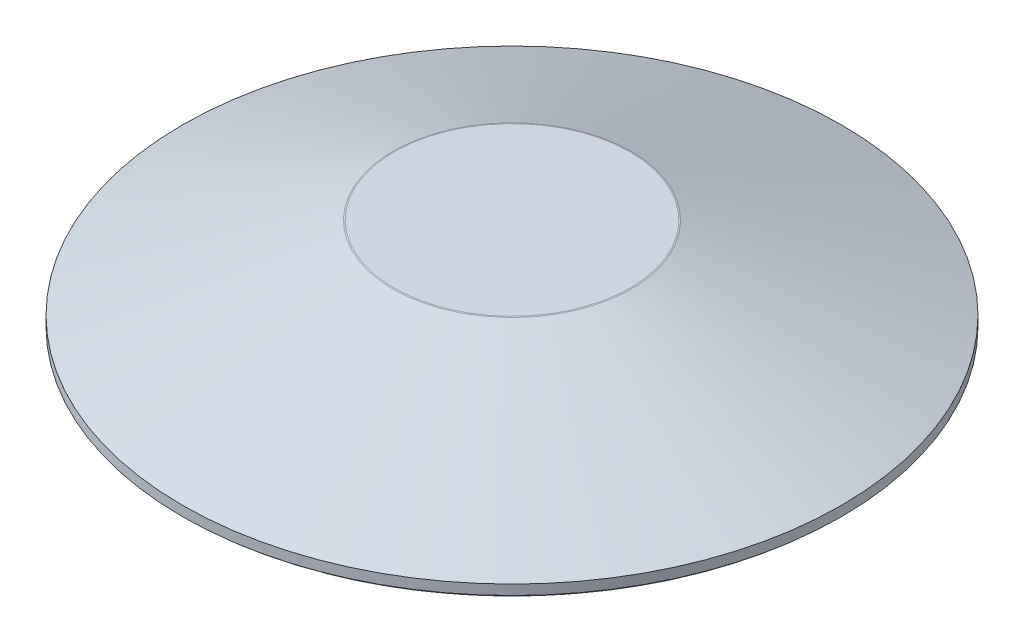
from build123d import *

# Parameters (mm, degrees)
FILLET1_R = 0.05


with BuildPart() as part:
    # Sketch1 → Revolve1 (revolve)
    with BuildSketch(Plane.XY, mode=Mode.PRIVATE) as revolve1_sk:
        with BuildLine():
            ThreePointArc((1.075, 1.2), (1.3, 0.7625), (1.075, 0.325))
            Line((1.075, 0.325), (0.9, 0.15))
            Line((0.9, 0.15), (0.9, 0))
            Line((0.9, 0), (0, 0))
            Line((0, 0), (0, 3.8))
            Line((0, 3.8), (1.8, 3.8))
            Line((1.8, 3.8), (5, 2.55))
            Line((5, 2.55), (5, 2.4))
            Line((5, 2.4), (4.5, 2.4))
            Line((4.5, 2.4), (1.9, 3.05))
            Line((1.9, 3.05), (1.9, 2.4))
            Line((1.9, 2.4), (1.075, 2.4))
            Line((1.075, 2.4), (1.075, 1.2))
        make_face()
        with BuildLine():
            Line((5, 2.4), (4.5, 2.4))
            ThreePointArc((4.5, 2.4), (4.75, 2.295756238), (5, 2.4))
        make_face()
    revolve(revolve1_sk.sketch.rotate(Axis((0, 0, 0), (0, 1, 0)), 90), axis=Axis((0, 0, 0), (0, 1, 0)))

    # Fillet1
    fillet1_edges = [part.edges().sort_by_distance(p)[0] for p in [
        (0, 0.325, 1.075),
        (0, 0.15, 0.9),
        (0, 3.8, 1.8),
        (0, 3.05, 1.9),
        (0, 2.4, 1.9),
        (0, 2.4, 1.075),
        (0, 1.2, 1.075),
    ]]
    fillet(fillet1_edges, radius=FILLET1_R)


solid = part.part
